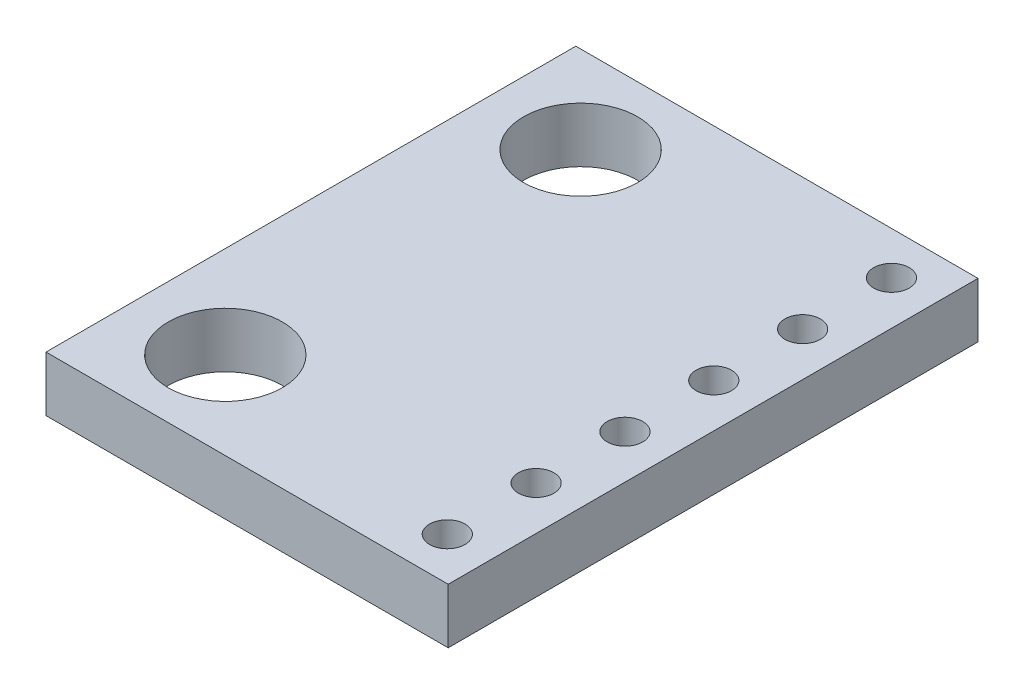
from build123d import *

# Parameters (mm, degrees)
SKETCH1_W           = 11.5
SKETCH1_H           = 15.15
SKETCH1_R           = 1.63195
SKETCH1_R_2         = 0.508
BOSS_EXTRUDE1_DEPTH = 1.5748


with BuildPart() as part:
    # Sketch1 → Boss-Extrude1 (new body)
    with BuildSketch(Plane(origin=(0, 0, 0), x_dir=(1, 0, 0), z_dir=(0, 1, 0))):
        with Locations((5.75, 7.575)):
            Rectangle(SKETCH1_W, SKETCH1_H)
        with Locations(Location((2.63195, 12.655, 0), (0, 0, 270))):
            Circle(SKETCH1_R, mode=Mode.SUBTRACT)
        with Locations(Location((2.63195, 2.495, 0), (0, 0, 270))):
            Circle(SKETCH1_R, mode=Mode.SUBTRACT)
        with Locations(Location((10.25, 13.925, 0), (0, 0, 270))):
            Circle(SKETCH1_R_2, mode=Mode.SUBTRACT)
        with Locations(Location((10.25, 11.385, 0), (0, 0, 270))):
            Circle(SKETCH1_R_2, mode=Mode.SUBTRACT)
        with Locations(Location((10.25, 8.845, 0), (0, 0, 270))):
            Circle(SKETCH1_R_2, mode=Mode.SUBTRACT)
        with Locations(Location((10.25, 6.305, 0), (0, 0, 270))):
            Circle(SKETCH1_R_2, mode=Mode.SUBTRACT)
        with Locations(Location((10.25, 3.765, 0), (0, 0, 270))):
            Circle(SKETCH1_R_2, mode=Mode.SUBTRACT)
        with Locations(Location((10.25, 1.225, 0), (0, 0, 270))):
            Circle(SKETCH1_R_2, mode=Mode.SUBTRACT)
    extrude(amount=BOSS_EXTRUDE1_DEPTH)


solid = part.part
